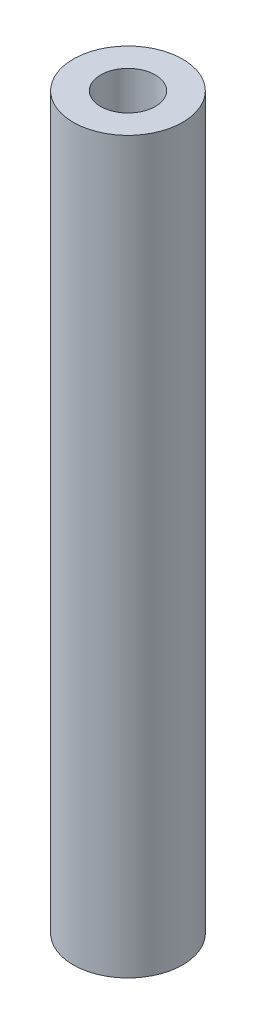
ISO-10303-21;
HEADER;
FILE_DESCRIPTION(('STEP AP214'),'2;1');
FILE_NAME('part.step','',(''),(''),'','','');
FILE_SCHEMA(('AUTOMOTIVE_DESIGN { 1 0 10303 214 1 1 1 1 }'));
ENDSEC;
DATA;
#1=APPLICATION_CONTEXT('core data for automotive mechanical design processes');
#2=APPLICATION_PROTOCOL_DEFINITION('international standard','automotive_design',2000,#1);
#3=PRODUCT_CONTEXT('',#1,'mechanical');
#4=PRODUCT('Part','Part','',(#3));
#5=PRODUCT_RELATED_PRODUCT_CATEGORY('part','',(#4));
#6=PRODUCT_DEFINITION_FORMATION('','',#4);
#7=PRODUCT_DEFINITION_CONTEXT('part definition',#1,'design');
#8=PRODUCT_DEFINITION('design','',#6,#7);
#9=PRODUCT_DEFINITION_SHAPE('','',#8);
#10=(LENGTH_UNIT() NAMED_UNIT(*) SI_UNIT(.MILLI.,.METRE.));
#11=(NAMED_UNIT(*) PLANE_ANGLE_UNIT() SI_UNIT($,.RADIAN.));
#12=(NAMED_UNIT(*) SI_UNIT($,.STERADIAN.) SOLID_ANGLE_UNIT());
#13=UNCERTAINTY_MEASURE_WITH_UNIT(LENGTH_MEASURE(1.E-05),#10,'distance_accuracy_value','');
#14=(GEOMETRIC_REPRESENTATION_CONTEXT(3) GLOBAL_UNCERTAINTY_ASSIGNED_CONTEXT((#13)) GLOBAL_UNIT_ASSIGNED_CONTEXT((#10,
#11,#12)) REPRESENTATION_CONTEXT('',''));
#15=CARTESIAN_POINT('',(0.,0.,0.));
#16=DIRECTION('',(0.,0.,1.));
#17=DIRECTION('',(1.,0.,0.));
#18=AXIS2_PLACEMENT_3D('',#15,#16,#17);
#19=CARTESIAN_POINT('',(0.,40.,0.));
#20=DIRECTION('',(0.,-1.,0.));
#21=DIRECTION('',(0.,0.,-1.));
#22=AXIS2_PLACEMENT_3D('',#19,#20,#21);
#23=CYLINDRICAL_SURFACE('',#22,3.);
#24=CARTESIAN_POINT('',(0.,40.,0.));
#25=DIRECTION('',(0.,1.,0.));
#26=DIRECTION('',(0.,0.,1.));
#27=AXIS2_PLACEMENT_3D('',#24,#25,#26);
#28=CIRCLE('',#27,3.);
#29=CARTESIAN_POINT('',(0.,40.,3.));
#30=VERTEX_POINT('',#29);
#31=EDGE_CURVE('E10',#30,#30,#28,.T.);
#32=ORIENTED_EDGE('',*,*,#31,.F.);
#33=EDGE_LOOP('',(#32));
#34=FACE_BOUND('',#33,.T.);
#35=CARTESIAN_POINT('',(0.,0.,0.));
#36=DIRECTION('',(0.,1.,0.));
#37=DIRECTION('',(0.,0.,1.));
#38=AXIS2_PLACEMENT_3D('',#35,#36,#37);
#39=CIRCLE('',#38,3.);
#40=CARTESIAN_POINT('',(0.,0.,3.));
#41=VERTEX_POINT('',#40);
#42=EDGE_CURVE('E33',#41,#41,#39,.T.);
#43=ORIENTED_EDGE('',*,*,#42,.T.);
#44=EDGE_LOOP('',(#43));
#45=FACE_BOUND('',#44,.T.);
#46=ADVANCED_FACE('F30',(#34,#45),#23,.T.);
#47=CARTESIAN_POINT('',(0.,40.,0.));
#48=DIRECTION('',(0.,1.,0.));
#49=DIRECTION('',(0.,0.,1.));
#50=AXIS2_PLACEMENT_3D('',#47,#48,#49);
#51=PLANE('',#50);
#52=CARTESIAN_POINT('',(0.,40.,0.));
#53=DIRECTION('',(0.,1.,0.));
#54=DIRECTION('',(0.,0.,1.));
#55=AXIS2_PLACEMENT_3D('',#52,#53,#54);
#56=CIRCLE('',#55,1.5);
#57=CARTESIAN_POINT('',(0.,40.,1.5));
#58=VERTEX_POINT('',#57);
#59=EDGE_CURVE('E42',#58,#58,#56,.T.);
#60=ORIENTED_EDGE('',*,*,#59,.F.);
#61=EDGE_LOOP('',(#60));
#62=FACE_BOUND('',#61,.T.);
#63=ORIENTED_EDGE('',*,*,#31,.T.);
#64=EDGE_LOOP('',(#63));
#65=FACE_BOUND('',#64,.T.);
#66=ADVANCED_FACE('F67',(#62,#65),#51,.T.);
#67=CARTESIAN_POINT('',(0.,0.,0.));
#68=DIRECTION('',(0.,1.,0.));
#69=DIRECTION('',(0.,0.,1.));
#70=AXIS2_PLACEMENT_3D('',#67,#68,#69);
#71=PLANE('',#70);
#72=CARTESIAN_POINT('',(0.,0.,0.));
#73=DIRECTION('',(0.,-1.,0.));
#74=DIRECTION('',(0.,0.,-1.));
#75=AXIS2_PLACEMENT_3D('',#72,#73,#74);
#76=CIRCLE('',#75,1.5);
#77=CARTESIAN_POINT('',(0.,0.,-1.5));
#78=VERTEX_POINT('',#77);
#79=EDGE_CURVE('E48',#78,#78,#76,.T.);
#80=ORIENTED_EDGE('',*,*,#79,.F.);
#81=EDGE_LOOP('',(#80));
#82=FACE_BOUND('',#81,.T.);
#83=ORIENTED_EDGE('',*,*,#42,.F.);
#84=EDGE_LOOP('',(#83));
#85=FACE_BOUND('',#84,.T.);
#86=ADVANCED_FACE('F63',(#82,#85),#71,.F.);
#87=CARTESIAN_POINT('',(0.,36.5,0.));
#88=DIRECTION('',(0.,1.,0.));
#89=DIRECTION('',(0.,0.,1.));
#90=AXIS2_PLACEMENT_3D('',#87,#88,#89);
#91=CYLINDRICAL_SURFACE('',#90,1.5);
#92=CARTESIAN_POINT('',(0.,36.5,0.));
#93=DIRECTION('',(0.,1.,0.));
#94=DIRECTION('',(0.,0.,1.));
#95=AXIS2_PLACEMENT_3D('',#92,#93,#94);
#96=CIRCLE('',#95,1.5);
#97=CARTESIAN_POINT('',(0.,36.5,1.5));
#98=VERTEX_POINT('',#97);
#99=EDGE_CURVE('E40',#98,#98,#96,.T.);
#100=ORIENTED_EDGE('',*,*,#99,.F.);
#101=EDGE_LOOP('',(#100));
#102=FACE_BOUND('',#101,.T.);
#103=ORIENTED_EDGE('',*,*,#59,.T.);
#104=EDGE_LOOP('',(#103));
#105=FACE_BOUND('',#104,.T.);
#106=ADVANCED_FACE('F66',(#102,#105),#91,.F.);
#107=CARTESIAN_POINT('',(0.,36.5,0.));
#108=DIRECTION('',(0.,1.,0.));
#109=DIRECTION('',(0.,0.,1.));
#110=AXIS2_PLACEMENT_3D('',#107,#108,#109);
#111=PLANE('',#110);
#112=ORIENTED_EDGE('',*,*,#99,.T.);
#113=EDGE_LOOP('',(#112));
#114=FACE_BOUND('',#113,.T.);
#115=ADVANCED_FACE('F59',(#114),#111,.T.);
#116=CARTESIAN_POINT('',(0.,4.5,0.));
#117=DIRECTION('',(0.,-1.,0.));
#118=DIRECTION('',(0.,0.,-1.));
#119=AXIS2_PLACEMENT_3D('',#116,#117,#118);
#120=CYLINDRICAL_SURFACE('',#119,1.5);
#121=CARTESIAN_POINT('',(0.,4.5,0.));
#122=DIRECTION('',(0.,-1.,0.));
#123=DIRECTION('',(0.,0.,-1.));
#124=AXIS2_PLACEMENT_3D('',#121,#122,#123);
#125=CIRCLE('',#124,1.5);
#126=CARTESIAN_POINT('',(0.,4.5,-1.5));
#127=VERTEX_POINT('',#126);
#128=EDGE_CURVE('E45',#127,#127,#125,.T.);
#129=ORIENTED_EDGE('',*,*,#128,.F.);
#130=EDGE_LOOP('',(#129));
#131=FACE_BOUND('',#130,.T.);
#132=ORIENTED_EDGE('',*,*,#79,.T.);
#133=EDGE_LOOP('',(#132));
#134=FACE_BOUND('',#133,.T.);
#135=ADVANCED_FACE('F56',(#131,#134),#120,.F.);
#136=CARTESIAN_POINT('',(0.,4.5,0.));
#137=DIRECTION('',(0.,-1.,0.));
#138=DIRECTION('',(0.,0.,-1.));
#139=AXIS2_PLACEMENT_3D('',#136,#137,#138);
#140=PLANE('',#139);
#141=ORIENTED_EDGE('',*,*,#128,.T.);
#142=EDGE_LOOP('',(#141));
#143=FACE_BOUND('',#142,.T.);
#144=ADVANCED_FACE('F54',(#143),#140,.T.);
#145=CLOSED_SHELL('',(#46,#66,#86,#106,#115,#135,#144));
#146=MANIFOLD_SOLID_BREP('B2',#145);
#147=ADVANCED_BREP_SHAPE_REPRESENTATION('',(#18,#146),#14);
#148=SHAPE_DEFINITION_REPRESENTATION(#9,#147);
ENDSEC;
END-ISO-10303-21;
